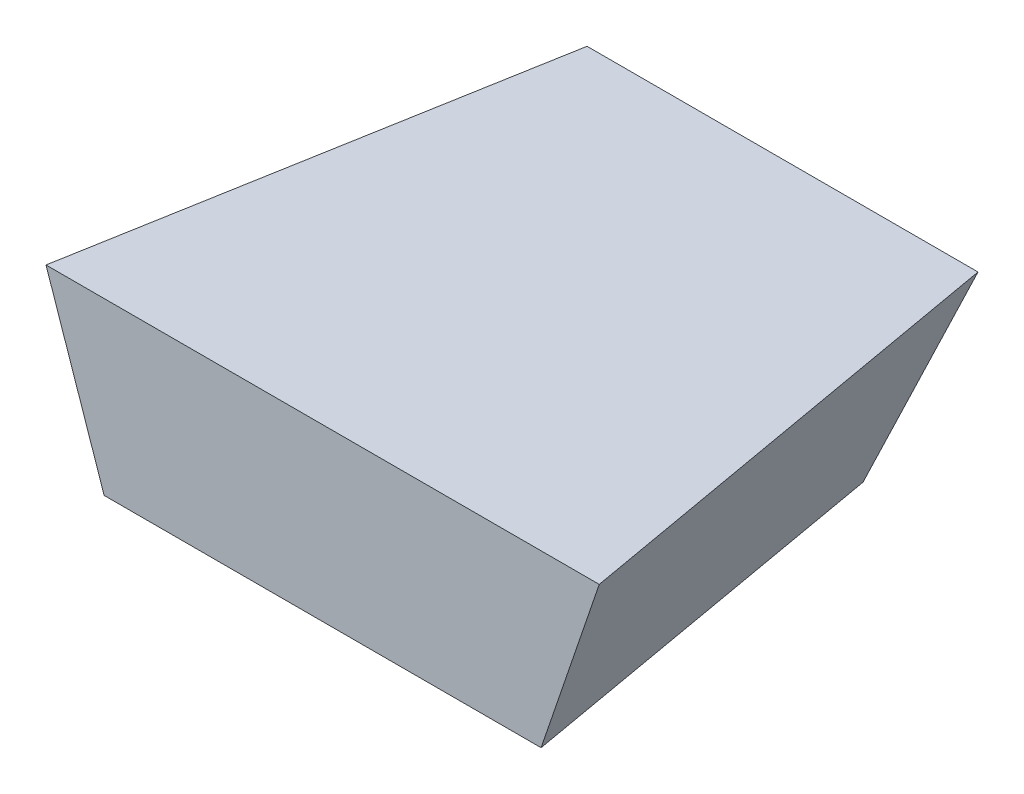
ISO-10303-21;
HEADER;
FILE_DESCRIPTION(('STEP AP214'),'2;1');
FILE_NAME('part.step','',(''),(''),'','','');
FILE_SCHEMA(('AUTOMOTIVE_DESIGN { 1 0 10303 214 1 1 1 1 }'));
ENDSEC;
DATA;
#1=APPLICATION_CONTEXT('core data for automotive mechanical design processes');
#2=APPLICATION_PROTOCOL_DEFINITION('international standard','automotive_design',2000,#1);
#3=PRODUCT_CONTEXT('',#1,'mechanical');
#4=PRODUCT('Part','Part','',(#3));
#5=PRODUCT_RELATED_PRODUCT_CATEGORY('part','',(#4));
#6=PRODUCT_DEFINITION_FORMATION('','',#4);
#7=PRODUCT_DEFINITION_CONTEXT('part definition',#1,'design');
#8=PRODUCT_DEFINITION('design','',#6,#7);
#9=PRODUCT_DEFINITION_SHAPE('','',#8);
#10=(LENGTH_UNIT() NAMED_UNIT(*) SI_UNIT(.MILLI.,.METRE.));
#11=(NAMED_UNIT(*) PLANE_ANGLE_UNIT() SI_UNIT($,.RADIAN.));
#12=(NAMED_UNIT(*) SI_UNIT($,.STERADIAN.) SOLID_ANGLE_UNIT());
#13=UNCERTAINTY_MEASURE_WITH_UNIT(LENGTH_MEASURE(1.E-05),#10,'distance_accuracy_value','');
#14=(GEOMETRIC_REPRESENTATION_CONTEXT(3) GLOBAL_UNCERTAINTY_ASSIGNED_CONTEXT((#13)) GLOBAL_UNIT_ASSIGNED_CONTEXT((#10,
#11,#12)) REPRESENTATION_CONTEXT('',''));
#15=CARTESIAN_POINT('',(0.,0.,0.));
#16=DIRECTION('',(0.,0.,1.));
#17=DIRECTION('',(1.,0.,0.));
#18=AXIS2_PLACEMENT_3D('',#15,#16,#17);
#19=CARTESIAN_POINT('',(0.,47.0928603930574,0.));
#20=DIRECTION('',(0.,1.,0.));
#21=DIRECTION('',(0.,0.,1.));
#22=AXIS2_PLACEMENT_3D('',#19,#20,#21);
#23=PLANE('',#22);
#24=DIRECTION('',(-0.173785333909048,0.,0.984783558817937));
#25=VECTOR('',#24,1.);
#26=CARTESIAN_POINT('',(-53.975,47.0928603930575,-127.));
#27=LINE('',#26,#25);
#28=CARTESIAN_POINT('',(-53.975,47.0928603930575,-127.));
#29=VERTEX_POINT('',#28);
#30=CARTESIAN_POINT('',(-76.3867647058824,47.0928603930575,0.));
#31=VERTEX_POINT('',#30);
#32=EDGE_CURVE('E118',#29,#31,#27,.T.);
#33=ORIENTED_EDGE('',*,*,#32,.T.);
#34=DIRECTION('',(1.,0.,0.));
#35=VECTOR('',#34,1.);
#36=CARTESIAN_POINT('',(-76.3867647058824,47.0928603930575,0.));
#37=LINE('',#36,#35);
#38=CARTESIAN_POINT('',(76.3867647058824,47.0928603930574,0.));
#39=VERTEX_POINT('',#38);
#40=EDGE_CURVE('E116',#31,#39,#37,.T.);
#41=ORIENTED_EDGE('',*,*,#40,.T.);
#42=DIRECTION('',(-0.173785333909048,0.,-0.984783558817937));
#43=VECTOR('',#42,1.);
#44=CARTESIAN_POINT('',(53.975,47.0928603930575,-127.));
#45=LINE('',#44,#43);
#46=CARTESIAN_POINT('',(53.975,47.0928603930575,-127.));
#47=VERTEX_POINT('',#46);
#48=EDGE_CURVE('E52',#39,#47,#45,.T.);
#49=ORIENTED_EDGE('',*,*,#48,.T.);
#50=DIRECTION('',(-1.,0.,0.));
#51=VECTOR('',#50,1.);
#52=CARTESIAN_POINT('',(-53.975,47.0928603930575,-127.));
#53=LINE('',#52,#51);
#54=EDGE_CURVE('E12',#47,#29,#53,.T.);
#55=ORIENTED_EDGE('',*,*,#54,.T.);
#56=EDGE_LOOP('',(#33,#41,#49,#55));
#57=FACE_BOUND('',#56,.T.);
#58=ADVANCED_FACE('F42',(#57),#23,.T.);
#59=CARTESIAN_POINT('',(0.,0.,0.));
#60=DIRECTION('',(0.,1.,0.));
#61=DIRECTION('',(0.,0.,1.));
#62=AXIS2_PLACEMENT_3D('',#59,#60,#61);
#63=PLANE('',#62);
#64=DIRECTION('',(-0.173785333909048,0.,0.984783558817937));
#65=VECTOR('',#64,1.);
#66=CARTESIAN_POINT('',(-41.275,0.,-107.95));
#67=LINE('',#66,#65);
#68=CARTESIAN_POINT('',(-41.275,0.,-107.95));
#69=VERTEX_POINT('',#68);
#70=CARTESIAN_POINT('',(-60.325,0.,0.));
#71=VERTEX_POINT('',#70);
#72=EDGE_CURVE('E91',#69,#71,#67,.T.);
#73=ORIENTED_EDGE('',*,*,#72,.F.);
#74=DIRECTION('',(-1.,0.,0.));
#75=VECTOR('',#74,1.);
#76=CARTESIAN_POINT('',(41.275,0.,-107.95));
#77=LINE('',#76,#75);
#78=CARTESIAN_POINT('',(41.275,0.,-107.95));
#79=VERTEX_POINT('',#78);
#80=EDGE_CURVE('E170',#79,#69,#77,.T.);
#81=ORIENTED_EDGE('',*,*,#80,.F.);
#82=DIRECTION('',(-0.173785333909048,0.,-0.984783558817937));
#83=VECTOR('',#82,1.);
#84=CARTESIAN_POINT('',(60.325,0.,0.));
#85=LINE('',#84,#83);
#86=CARTESIAN_POINT('',(60.325,0.,0.));
#87=VERTEX_POINT('',#86);
#88=EDGE_CURVE('E93',#87,#79,#85,.T.);
#89=ORIENTED_EDGE('',*,*,#88,.F.);
#90=DIRECTION('',(1.,0.,0.));
#91=VECTOR('',#90,1.);
#92=CARTESIAN_POINT('',(-60.325,0.,0.));
#93=LINE('',#92,#91);
#94=EDGE_CURVE('E87',#71,#87,#93,.T.);
#95=ORIENTED_EDGE('',*,*,#94,.F.);
#96=EDGE_LOOP('',(#73,#81,#89,#95));
#97=FACE_BOUND('',#96,.T.);
#98=ADVANCED_FACE('F90',(#97),#63,.F.);
#99=CARTESIAN_POINT('',(52.5722832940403,-17.9306085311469,-9.27746175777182));
#100=DIRECTION('',(-0.933533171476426,0.318396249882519,0.164741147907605));
#101=DIRECTION('',(-0.322806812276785,-0.946464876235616,0.));
#102=AXIS2_PLACEMENT_3D('',#99,#100,#101);
#103=PLANE('',#102);
#104=DIRECTION('',(0.242535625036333,0.899346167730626,-0.3638034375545));
#105=VECTOR('',#104,1.);
#106=CARTESIAN_POINT('',(41.275,0.,-107.95));
#107=LINE('',#106,#105);
#108=EDGE_CURVE('E60',#79,#47,#107,.T.);
#109=ORIENTED_EDGE('',*,*,#108,.T.);
#110=ORIENTED_EDGE('',*,*,#48,.F.);
#111=DIRECTION('',(0.322806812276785,0.946464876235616,0.));
#112=VECTOR('',#111,1.);
#113=CARTESIAN_POINT('',(60.325,0.,0.));
#114=LINE('',#113,#112);
#115=EDGE_CURVE('E121',#87,#39,#114,.T.);
#116=ORIENTED_EDGE('',*,*,#115,.F.);
#117=ORIENTED_EDGE('',*,*,#88,.T.);
#118=EDGE_LOOP('',(#109,#110,#116,#117));
#119=FACE_BOUND('',#118,.T.);
#120=ADVANCED_FACE('F143',(#119),#103,.F.);
#121=CARTESIAN_POINT('',(0.,0.,0.));
#122=DIRECTION('',(0.,0.,-1.));
#123=DIRECTION('',(-1.,0.,0.));
#124=AXIS2_PLACEMENT_3D('',#121,#122,#123);
#125=PLANE('',#124);
#126=ORIENTED_EDGE('',*,*,#115,.T.);
#127=ORIENTED_EDGE('',*,*,#40,.F.);
#128=DIRECTION('',(-0.322806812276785,0.946464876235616,0.));
#129=VECTOR('',#128,1.);
#130=CARTESIAN_POINT('',(-60.325,0.,0.));
#131=LINE('',#130,#129);
#132=EDGE_CURVE('E107',#71,#31,#131,.T.);
#133=ORIENTED_EDGE('',*,*,#132,.F.);
#134=ORIENTED_EDGE('',*,*,#94,.T.);
#135=EDGE_LOOP('',(#126,#127,#133,#134));
#136=FACE_BOUND('',#135,.T.);
#137=ADVANCED_FACE('F114',(#136),#125,.F.);
#138=CARTESIAN_POINT('',(0.,-37.5271231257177,-92.76953125));
#139=DIRECTION('',(0.,0.375,0.927024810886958));
#140=DIRECTION('',(0.,-0.927024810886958,0.375));
#141=AXIS2_PLACEMENT_3D('',#138,#139,#140);
#142=PLANE('',#141);
#143=DIRECTION('',(-0.242535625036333,0.899346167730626,-0.3638034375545));
#144=VECTOR('',#143,1.);
#145=CARTESIAN_POINT('',(-41.275,0.,-107.95));
#146=LINE('',#145,#144);
#147=EDGE_CURVE('E109',#69,#29,#146,.T.);
#148=ORIENTED_EDGE('',*,*,#147,.T.);
#149=ORIENTED_EDGE('',*,*,#54,.F.);
#150=ORIENTED_EDGE('',*,*,#108,.F.);
#151=ORIENTED_EDGE('',*,*,#80,.T.);
#152=EDGE_LOOP('',(#148,#149,#150,#151));
#153=FACE_BOUND('',#152,.T.);
#154=ADVANCED_FACE('F142',(#153),#142,.F.);
#155=CARTESIAN_POINT('',(-52.5722832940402,-17.9306085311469,-9.27746175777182));
#156=DIRECTION('',(0.933533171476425,0.318396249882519,0.164741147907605));
#157=DIRECTION('',(-0.322806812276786,0.946464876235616,0.));
#158=AXIS2_PLACEMENT_3D('',#155,#156,#157);
#159=PLANE('',#158);
#160=ORIENTED_EDGE('',*,*,#132,.T.);
#161=ORIENTED_EDGE('',*,*,#32,.F.);
#162=ORIENTED_EDGE('',*,*,#147,.F.);
#163=ORIENTED_EDGE('',*,*,#72,.T.);
#164=EDGE_LOOP('',(#160,#161,#162,#163));
#165=FACE_BOUND('',#164,.T.);
#166=ADVANCED_FACE('F106',(#165),#159,.F.);
#167=CLOSED_SHELL('',(#58,#98,#120,#137,#154,#166));
#168=MANIFOLD_SOLID_BREP('B2',#167);
#169=ADVANCED_BREP_SHAPE_REPRESENTATION('',(#18,#168),#14);
#170=SHAPE_DEFINITION_REPRESENTATION(#9,#169);
ENDSEC;
END-ISO-10303-21;
